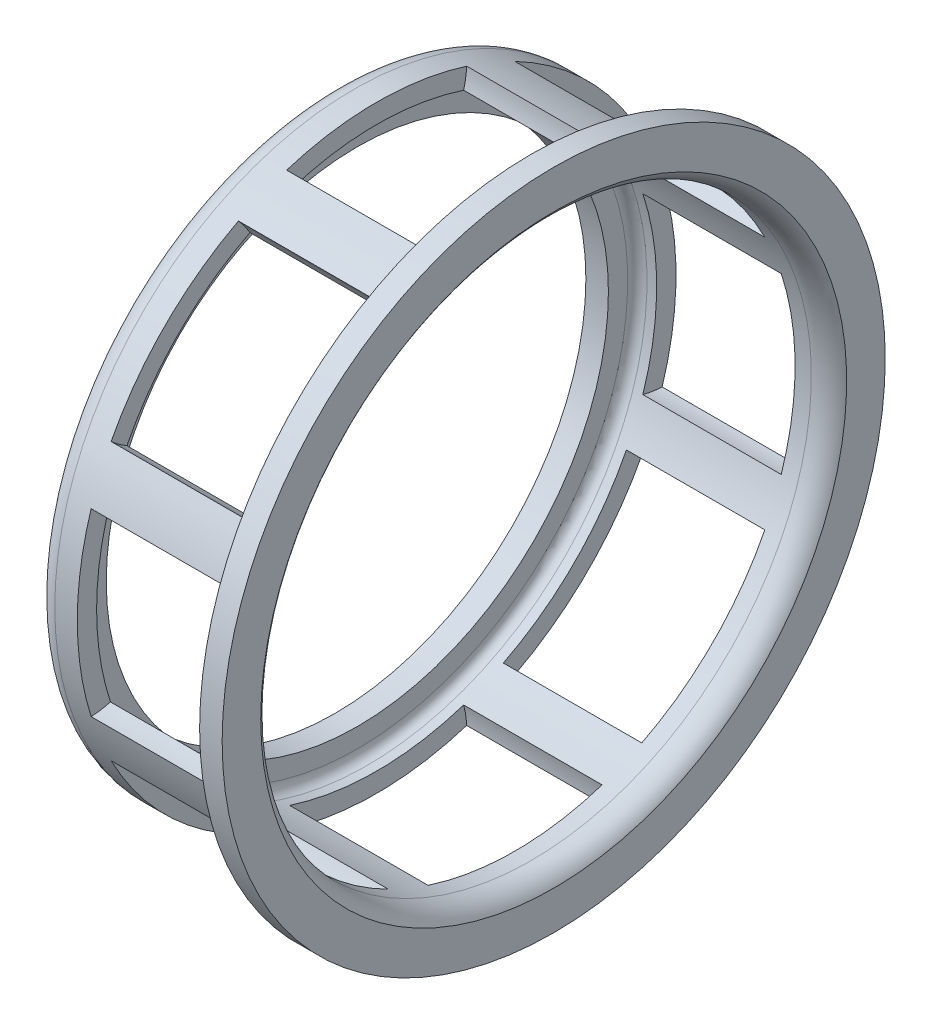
ISO-10303-21;
HEADER;
FILE_DESCRIPTION(('STEP AP214'),'2;1');
FILE_NAME('part.step','',(''),(''),'','','');
FILE_SCHEMA(('AUTOMOTIVE_DESIGN { 1 0 10303 214 1 1 1 1 }'));
ENDSEC;
DATA;
#1=APPLICATION_CONTEXT('core data for automotive mechanical design processes');
#2=APPLICATION_PROTOCOL_DEFINITION('international standard','automotive_design',2000,#1);
#3=PRODUCT_CONTEXT('',#1,'mechanical');
#4=PRODUCT('Part','Part','',(#3));
#5=PRODUCT_RELATED_PRODUCT_CATEGORY('part','',(#4));
#6=PRODUCT_DEFINITION_FORMATION('','',#4);
#7=PRODUCT_DEFINITION_CONTEXT('part definition',#1,'design');
#8=PRODUCT_DEFINITION('design','',#6,#7);
#9=PRODUCT_DEFINITION_SHAPE('','',#8);
#10=(LENGTH_UNIT() NAMED_UNIT(*) SI_UNIT(.MILLI.,.METRE.));
#11=(NAMED_UNIT(*) PLANE_ANGLE_UNIT() SI_UNIT($,.RADIAN.));
#12=(NAMED_UNIT(*) SI_UNIT($,.STERADIAN.) SOLID_ANGLE_UNIT());
#13=UNCERTAINTY_MEASURE_WITH_UNIT(LENGTH_MEASURE(1.E-05),#10,'distance_accuracy_value','');
#14=(GEOMETRIC_REPRESENTATION_CONTEXT(3) GLOBAL_UNCERTAINTY_ASSIGNED_CONTEXT((#13)) GLOBAL_UNIT_ASSIGNED_CONTEXT((#10,
#11,#12)) REPRESENTATION_CONTEXT('',''));
#15=CARTESIAN_POINT('',(0.,0.,0.));
#16=DIRECTION('',(0.,0.,1.));
#17=DIRECTION('',(1.,0.,0.));
#18=AXIS2_PLACEMENT_3D('',#15,#16,#17);
#19=CARTESIAN_POINT('',(-5.6,0.,0.));
#20=DIRECTION('',(-1.,0.,0.));
#21=DIRECTION('',(0.,0.,1.));
#22=AXIS2_PLACEMENT_3D('',#19,#20,#21);
#23=CYLINDRICAL_SURFACE('',#22,7.8);
#24=CARTESIAN_POINT('',(-2.7,0.,0.));
#25=DIRECTION('',(-1.,0.,0.));
#26=DIRECTION('',(0.,0.,1.));
#27=AXIS2_PLACEMENT_3D('',#24,#25,#26);
#28=CIRCLE('',#27,7.8);
#29=CARTESIAN_POINT('',(-2.7,0.,7.8));
#30=VERTEX_POINT('',#29);
#31=EDGE_CURVE('E381',#30,#30,#28,.T.);
#32=ORIENTED_EDGE('',*,*,#31,.F.);
#33=EDGE_LOOP('',(#32));
#34=FACE_BOUND('',#33,.T.);
#35=CARTESIAN_POINT('',(-3.4,0.,0.));
#36=DIRECTION('',(-1.,0.,0.));
#37=DIRECTION('',(0.,0.,1.));
#38=AXIS2_PLACEMENT_3D('',#35,#36,#37);
#39=CIRCLE('',#38,7.8);
#40=CARTESIAN_POINT('',(-3.4,0.,7.8));
#41=VERTEX_POINT('',#40);
#42=EDGE_CURVE('E414',#41,#41,#39,.T.);
#43=ORIENTED_EDGE('',*,*,#42,.T.);
#44=EDGE_LOOP('',(#43));
#45=FACE_BOUND('',#44,.T.);
#46=ADVANCED_FACE('F31',(#34,#45),#23,.F.);
#47=CARTESIAN_POINT('',(-3.4,7.8,0.));
#48=DIRECTION('',(-1.,0.,0.));
#49=DIRECTION('',(0.,0.,1.));
#50=AXIS2_PLACEMENT_3D('',#47,#48,#49);
#51=PLANE('',#50);
#52=CARTESIAN_POINT('',(-3.4,0.,0.));
#53=DIRECTION('',(-1.,0.,0.));
#54=DIRECTION('',(0.,0.,1.));
#55=AXIS2_PLACEMENT_3D('',#52,#53,#54);
#56=CIRCLE('',#55,8.7);
#57=CARTESIAN_POINT('',(-3.4,0.,8.7));
#58=VERTEX_POINT('',#57);
#59=EDGE_CURVE('E411',#58,#58,#56,.T.);
#60=ORIENTED_EDGE('',*,*,#59,.T.);
#61=EDGE_LOOP('',(#60));
#62=FACE_BOUND('',#61,.T.);
#63=ORIENTED_EDGE('',*,*,#42,.F.);
#64=EDGE_LOOP('',(#63));
#65=FACE_BOUND('',#64,.T.);
#66=ADVANCED_FACE('F544',(#62,#65),#51,.T.);
#67=CARTESIAN_POINT('',(-2.80000000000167,0.,0.));
#68=DIRECTION('',(-1.,0.,0.));
#69=DIRECTION('',(0.,0.,1.));
#70=AXIS2_PLACEMENT_3D('',#67,#68,#69);
#71=TOROIDAL_SURFACE('',#70,8.7,0.599999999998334);
#72=CARTESIAN_POINT('',(-2.80000000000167,0.,0.));
#73=DIRECTION('',(-1.,0.,0.));
#74=DIRECTION('',(0.,0.,1.));
#75=AXIS2_PLACEMENT_3D('',#72,#73,#74);
#76=CIRCLE('',#75,9.29999999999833);
#77=CARTESIAN_POINT('',(-2.80000000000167,0.,9.29999999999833));
#78=VERTEX_POINT('',#77);
#79=EDGE_CURVE('E408',#78,#78,#76,.T.);
#80=ORIENTED_EDGE('',*,*,#79,.T.);
#81=EDGE_LOOP('',(#80));
#82=FACE_BOUND('',#81,.T.);
#83=ORIENTED_EDGE('',*,*,#59,.F.);
#84=EDGE_LOOP('',(#83));
#85=FACE_BOUND('',#84,.T.);
#86=ADVANCED_FACE('F548',(#82,#85),#71,.T.);
#87=CARTESIAN_POINT('',(-5.6,0.,0.));
#88=DIRECTION('',(-1.,0.,0.));
#89=DIRECTION('',(0.,0.,1.));
#90=AXIS2_PLACEMENT_3D('',#87,#88,#89);
#91=CYLINDRICAL_SURFACE('',#90,9.29999999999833);
#92=DIRECTION('',(-1.,0.,0.));
#93=VECTOR('',#92,1.);
#94=CARTESIAN_POINT('',(0.0499999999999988,-8.24938990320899,-4.29389872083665));
#95=LINE('',#94,#93);
#96=CARTESIAN_POINT('',(2.2,-8.24938990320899,-4.29389872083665));
#97=VERTEX_POINT('',#96);
#98=CARTESIAN_POINT('',(-2.1,-8.24938990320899,-4.29389872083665));
#99=VERTEX_POINT('',#98);
#100=EDGE_CURVE('E241',#97,#99,#95,.T.);
#101=ORIENTED_EDGE('',*,*,#100,.F.);
#102=CARTESIAN_POINT('',(2.2,0.,0.));
#103=DIRECTION('',(-1.,0.,0.));
#104=DIRECTION('',(0.,0.,1.));
#105=AXIS2_PLACEMENT_3D('',#102,#103,#104);
#106=CIRCLE('',#105,9.29999999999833);
#107=CARTESIAN_POINT('',(2.2,-4.29389872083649,-8.24938990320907));
#108=VERTEX_POINT('',#107);
#109=EDGE_CURVE('E246',#97,#108,#106,.F.);
#110=ORIENTED_EDGE('',*,*,#109,.T.);
#111=DIRECTION('',(-1.,0.,0.));
#112=VECTOR('',#111,1.);
#113=CARTESIAN_POINT('',(0.0499999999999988,-4.29389872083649,-8.24938990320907));
#114=LINE('',#113,#112);
#115=CARTESIAN_POINT('',(-2.1,-4.29389872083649,-8.24938990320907));
#116=VERTEX_POINT('',#115);
#117=EDGE_CURVE('E236',#116,#108,#114,.F.);
#118=ORIENTED_EDGE('',*,*,#117,.F.);
#119=CARTESIAN_POINT('',(-2.1,0.,0.));
#120=DIRECTION('',(1.,0.,0.));
#121=DIRECTION('',(0.,0.,-1.));
#122=AXIS2_PLACEMENT_3D('',#119,#120,#121);
#123=CIRCLE('',#122,9.29999999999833);
#124=EDGE_CURVE('E257',#116,#99,#123,.F.);
#125=ORIENTED_EDGE('',*,*,#124,.T.);
#126=EDGE_LOOP('',(#101,#110,#118,#125));
#127=FACE_BOUND('',#126,.T.);
#128=DIRECTION('',(-1.,0.,0.));
#129=VECTOR('',#128,1.);
#130=CARTESIAN_POINT('',(0.0499999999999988,-8.86944444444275,2.79695463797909));
#131=LINE('',#130,#129);
#132=CARTESIAN_POINT('',(2.2,-8.86944444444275,2.79695463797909));
#133=VERTEX_POINT('',#132);
#134=CARTESIAN_POINT('',(-2.1,-8.86944444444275,2.79695463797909));
#135=VERTEX_POINT('',#134);
#136=EDGE_CURVE('E271',#133,#135,#131,.T.);
#137=ORIENTED_EDGE('',*,*,#136,.F.);
#138=CARTESIAN_POINT('',(2.2,0.,0.));
#139=DIRECTION('',(-1.,0.,0.));
#140=DIRECTION('',(0.,0.,1.));
#141=AXIS2_PLACEMENT_3D('',#138,#139,#140);
#142=CIRCLE('',#141,9.29999999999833);
#143=CARTESIAN_POINT('',(2.2,-8.8694444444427,-2.79695463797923));
#144=VERTEX_POINT('',#143);
#145=EDGE_CURVE('E276',#133,#144,#142,.F.);
#146=ORIENTED_EDGE('',*,*,#145,.T.);
#147=DIRECTION('',(-1.,0.,0.));
#148=VECTOR('',#147,1.);
#149=CARTESIAN_POINT('',(0.0499999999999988,-8.8694444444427,-2.79695463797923));
#150=LINE('',#149,#148);
#151=CARTESIAN_POINT('',(-2.1,-8.8694444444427,-2.79695463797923));
#152=VERTEX_POINT('',#151);
#153=EDGE_CURVE('E269',#152,#144,#150,.F.);
#154=ORIENTED_EDGE('',*,*,#153,.F.);
#155=CARTESIAN_POINT('',(-2.1,0.,0.));
#156=DIRECTION('',(1.,0.,0.));
#157=DIRECTION('',(0.,0.,-1.));
#158=AXIS2_PLACEMENT_3D('',#155,#156,#157);
#159=CIRCLE('',#158,9.29999999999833);
#160=EDGE_CURVE('E273',#152,#135,#159,.F.);
#161=ORIENTED_EDGE('',*,*,#160,.T.);
#162=EDGE_LOOP('',(#137,#146,#154,#161));
#163=FACE_BOUND('',#162,.T.);
#164=DIRECTION('',(-1.,0.,0.));
#165=VECTOR('',#164,1.);
#166=CARTESIAN_POINT('',(0.0499999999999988,-4.29389872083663,8.249389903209));
#167=LINE('',#166,#165);
#168=CARTESIAN_POINT('',(2.2,-4.29389872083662,8.249389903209));
#169=VERTEX_POINT('',#168);
#170=CARTESIAN_POINT('',(-2.1,-4.29389872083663,8.249389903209));
#171=VERTEX_POINT('',#170);
#172=EDGE_CURVE('E288',#169,#171,#167,.T.);
#173=ORIENTED_EDGE('',*,*,#172,.F.);
#174=CARTESIAN_POINT('',(2.2,0.,0.));
#175=DIRECTION('',(-1.,0.,0.));
#176=DIRECTION('',(0.,0.,1.));
#177=AXIS2_PLACEMENT_3D('',#174,#175,#176);
#178=CIRCLE('',#177,9.29999999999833);
#179=CARTESIAN_POINT('',(2.2,-8.24938990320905,4.29389872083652));
#180=VERTEX_POINT('',#179);
#181=EDGE_CURVE('E293',#169,#180,#178,.F.);
#182=ORIENTED_EDGE('',*,*,#181,.T.);
#183=DIRECTION('',(-1.,0.,0.));
#184=VECTOR('',#183,1.);
#185=CARTESIAN_POINT('',(0.0499999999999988,-8.24938990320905,4.29389872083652));
#186=LINE('',#185,#184);
#187=CARTESIAN_POINT('',(-2.1,-8.24938990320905,4.29389872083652));
#188=VERTEX_POINT('',#187);
#189=EDGE_CURVE('E286',#188,#180,#186,.F.);
#190=ORIENTED_EDGE('',*,*,#189,.F.);
#191=CARTESIAN_POINT('',(-2.1,0.,0.));
#192=DIRECTION('',(1.,0.,0.));
#193=DIRECTION('',(0.,0.,-1.));
#194=AXIS2_PLACEMENT_3D('',#191,#192,#193);
#195=CIRCLE('',#194,9.29999999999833);
#196=EDGE_CURVE('E290',#188,#171,#195,.F.);
#197=ORIENTED_EDGE('',*,*,#196,.T.);
#198=EDGE_LOOP('',(#173,#182,#190,#197));
#199=FACE_BOUND('',#198,.T.);
#200=DIRECTION('',(-1.,0.,0.));
#201=VECTOR('',#200,1.);
#202=CARTESIAN_POINT('',(0.0499999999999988,2.79695463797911,8.86944444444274));
#203=LINE('',#202,#201);
#204=CARTESIAN_POINT('',(2.2,2.79695463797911,8.86944444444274));
#205=VERTEX_POINT('',#204);
#206=CARTESIAN_POINT('',(-2.1,2.79695463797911,8.86944444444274));
#207=VERTEX_POINT('',#206);
#208=EDGE_CURVE('E305',#205,#207,#203,.T.);
#209=ORIENTED_EDGE('',*,*,#208,.F.);
#210=CARTESIAN_POINT('',(2.2,0.,0.));
#211=DIRECTION('',(-1.,0.,0.));
#212=DIRECTION('',(0.,0.,1.));
#213=AXIS2_PLACEMENT_3D('',#210,#211,#212);
#214=CIRCLE('',#213,9.29999999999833);
#215=CARTESIAN_POINT('',(2.2,-2.79695463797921,8.86944444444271));
#216=VERTEX_POINT('',#215);
#217=EDGE_CURVE('E310',#205,#216,#214,.F.);
#218=ORIENTED_EDGE('',*,*,#217,.T.);
#219=DIRECTION('',(-1.,0.,0.));
#220=VECTOR('',#219,1.);
#221=CARTESIAN_POINT('',(0.0499999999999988,-2.7969546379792,8.86944444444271));
#222=LINE('',#221,#220);
#223=CARTESIAN_POINT('',(-2.1,-2.7969546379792,8.86944444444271));
#224=VERTEX_POINT('',#223);
#225=EDGE_CURVE('E303',#224,#216,#222,.F.);
#226=ORIENTED_EDGE('',*,*,#225,.F.);
#227=CARTESIAN_POINT('',(-2.1,0.,0.));
#228=DIRECTION('',(1.,0.,0.));
#229=DIRECTION('',(0.,0.,-1.));
#230=AXIS2_PLACEMENT_3D('',#227,#228,#229);
#231=CIRCLE('',#230,9.29999999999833);
#232=EDGE_CURVE('E307',#224,#207,#231,.F.);
#233=ORIENTED_EDGE('',*,*,#232,.T.);
#234=EDGE_LOOP('',(#209,#218,#226,#233));
#235=FACE_BOUND('',#234,.T.);
#236=DIRECTION('',(-1.,0.,0.));
#237=VECTOR('',#236,1.);
#238=CARTESIAN_POINT('',(0.0499999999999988,8.24938990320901,4.2938987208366));
#239=LINE('',#238,#237);
#240=CARTESIAN_POINT('',(2.2,8.24938990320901,4.2938987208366));
#241=VERTEX_POINT('',#240);
#242=CARTESIAN_POINT('',(-2.1,8.24938990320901,4.29389872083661));
#243=VERTEX_POINT('',#242);
#244=EDGE_CURVE('E322',#241,#243,#239,.T.);
#245=ORIENTED_EDGE('',*,*,#244,.F.);
#246=CARTESIAN_POINT('',(2.2,0.,0.));
#247=DIRECTION('',(-1.,0.,0.));
#248=DIRECTION('',(0.,0.,1.));
#249=AXIS2_PLACEMENT_3D('',#246,#247,#248);
#250=CIRCLE('',#249,9.29999999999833);
#251=CARTESIAN_POINT('',(2.2,4.29389872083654,8.24938990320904));
#252=VERTEX_POINT('',#251);
#253=EDGE_CURVE('E327',#241,#252,#250,.F.);
#254=ORIENTED_EDGE('',*,*,#253,.T.);
#255=DIRECTION('',(-1.,0.,0.));
#256=VECTOR('',#255,1.);
#257=CARTESIAN_POINT('',(0.0499999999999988,4.29389872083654,8.24938990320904));
#258=LINE('',#257,#256);
#259=CARTESIAN_POINT('',(-2.1,4.29389872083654,8.24938990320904));
#260=VERTEX_POINT('',#259);
#261=EDGE_CURVE('E320',#260,#252,#258,.F.);
#262=ORIENTED_EDGE('',*,*,#261,.F.);
#263=CARTESIAN_POINT('',(-2.1,0.,0.));
#264=DIRECTION('',(1.,0.,0.));
#265=DIRECTION('',(0.,0.,-1.));
#266=AXIS2_PLACEMENT_3D('',#263,#264,#265);
#267=CIRCLE('',#266,9.29999999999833);
#268=EDGE_CURVE('E324',#260,#243,#267,.F.);
#269=ORIENTED_EDGE('',*,*,#268,.T.);
#270=EDGE_LOOP('',(#245,#254,#262,#269));
#271=FACE_BOUND('',#270,.T.);
#272=DIRECTION('',(-1.,0.,0.));
#273=VECTOR('',#272,1.);
#274=CARTESIAN_POINT('',(0.0499999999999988,8.86944444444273,-2.79695463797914));
#275=LINE('',#274,#273);
#276=CARTESIAN_POINT('',(2.2,8.86944444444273,-2.79695463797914));
#277=VERTEX_POINT('',#276);
#278=CARTESIAN_POINT('',(-2.1,8.86944444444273,-2.79695463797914));
#279=VERTEX_POINT('',#278);
#280=EDGE_CURVE('E339',#277,#279,#275,.T.);
#281=ORIENTED_EDGE('',*,*,#280,.F.);
#282=CARTESIAN_POINT('',(2.2,0.,0.));
#283=DIRECTION('',(-1.,0.,0.));
#284=DIRECTION('',(0.,0.,1.));
#285=AXIS2_PLACEMENT_3D('',#282,#283,#284);
#286=CIRCLE('',#285,9.29999999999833);
#287=CARTESIAN_POINT('',(2.2,8.86944444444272,2.79695463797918));
#288=VERTEX_POINT('',#287);
#289=EDGE_CURVE('E344',#277,#288,#286,.F.);
#290=ORIENTED_EDGE('',*,*,#289,.T.);
#291=DIRECTION('',(-1.,0.,0.));
#292=VECTOR('',#291,1.);
#293=CARTESIAN_POINT('',(0.0499999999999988,8.86944444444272,2.79695463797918));
#294=LINE('',#293,#292);
#295=CARTESIAN_POINT('',(-2.1,8.86944444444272,2.79695463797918));
#296=VERTEX_POINT('',#295);
#297=EDGE_CURVE('E337',#296,#288,#294,.F.);
#298=ORIENTED_EDGE('',*,*,#297,.F.);
#299=CARTESIAN_POINT('',(-2.1,0.,0.));
#300=DIRECTION('',(1.,0.,0.));
#301=DIRECTION('',(0.,0.,-1.));
#302=AXIS2_PLACEMENT_3D('',#299,#300,#301);
#303=CIRCLE('',#302,9.29999999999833);
#304=EDGE_CURVE('E341',#296,#279,#303,.F.);
#305=ORIENTED_EDGE('',*,*,#304,.T.);
#306=EDGE_LOOP('',(#281,#290,#298,#305));
#307=FACE_BOUND('',#306,.T.);
#308=DIRECTION('',(-1.,0.,0.));
#309=VECTOR('',#308,1.);
#310=CARTESIAN_POINT('',(0.0499999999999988,4.29389872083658,-8.24938990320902));
#311=LINE('',#310,#309);
#312=CARTESIAN_POINT('',(2.2,4.29389872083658,-8.24938990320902));
#313=VERTEX_POINT('',#312);
#314=CARTESIAN_POINT('',(-2.1,4.29389872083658,-8.24938990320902));
#315=VERTEX_POINT('',#314);
#316=EDGE_CURVE('E356',#313,#315,#311,.T.);
#317=ORIENTED_EDGE('',*,*,#316,.F.);
#318=CARTESIAN_POINT('',(2.2,0.,0.));
#319=DIRECTION('',(-1.,0.,0.));
#320=DIRECTION('',(0.,0.,1.));
#321=AXIS2_PLACEMENT_3D('',#318,#319,#320);
#322=CIRCLE('',#321,9.29999999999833);
#323=CARTESIAN_POINT('',(2.2,8.24938990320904,-4.29389872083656));
#324=VERTEX_POINT('',#323);
#325=EDGE_CURVE('E361',#313,#324,#322,.F.);
#326=ORIENTED_EDGE('',*,*,#325,.T.);
#327=DIRECTION('',(-1.,0.,0.));
#328=VECTOR('',#327,1.);
#329=CARTESIAN_POINT('',(0.0499999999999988,8.24938990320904,-4.29389872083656));
#330=LINE('',#329,#328);
#331=CARTESIAN_POINT('',(-2.1,8.24938990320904,-4.29389872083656));
#332=VERTEX_POINT('',#331);
#333=EDGE_CURVE('E354',#332,#324,#330,.F.);
#334=ORIENTED_EDGE('',*,*,#333,.F.);
#335=CARTESIAN_POINT('',(-2.1,0.,0.));
#336=DIRECTION('',(1.,0.,0.));
#337=DIRECTION('',(0.,0.,-1.));
#338=AXIS2_PLACEMENT_3D('',#335,#336,#337);
#339=CIRCLE('',#338,9.29999999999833);
#340=EDGE_CURVE('E358',#332,#315,#339,.F.);
#341=ORIENTED_EDGE('',*,*,#340,.T.);
#342=EDGE_LOOP('',(#317,#326,#334,#341));
#343=FACE_BOUND('',#342,.T.);
#344=DIRECTION('',(-1.,0.,0.));
#345=VECTOR('',#344,1.);
#346=CARTESIAN_POINT('',(0.0499999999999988,-2.79695463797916,-8.86944444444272));
#347=LINE('',#346,#345);
#348=CARTESIAN_POINT('',(2.2,-2.79695463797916,-8.86944444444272));
#349=VERTEX_POINT('',#348);
#350=CARTESIAN_POINT('',(-2.1,-2.79695463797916,-8.86944444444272));
#351=VERTEX_POINT('',#350);
#352=EDGE_CURVE('E373',#349,#351,#347,.T.);
#353=ORIENTED_EDGE('',*,*,#352,.F.);
#354=CARTESIAN_POINT('',(2.2,0.,0.));
#355=DIRECTION('',(-1.,0.,0.));
#356=DIRECTION('',(0.,0.,1.));
#357=AXIS2_PLACEMENT_3D('',#354,#355,#356);
#358=CIRCLE('',#357,9.29999999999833);
#359=CARTESIAN_POINT('',(2.2,2.79695463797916,-8.86944444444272));
#360=VERTEX_POINT('',#359);
#361=EDGE_CURVE('E378',#349,#360,#358,.F.);
#362=ORIENTED_EDGE('',*,*,#361,.T.);
#363=DIRECTION('',(-1.,0.,0.));
#364=VECTOR('',#363,1.);
#365=CARTESIAN_POINT('',(0.0499999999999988,2.79695463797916,-8.86944444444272));
#366=LINE('',#365,#364);
#367=CARTESIAN_POINT('',(-2.1,2.79695463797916,-8.86944444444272));
#368=VERTEX_POINT('',#367);
#369=EDGE_CURVE('E371',#368,#360,#366,.F.);
#370=ORIENTED_EDGE('',*,*,#369,.F.);
#371=CARTESIAN_POINT('',(-2.1,0.,0.));
#372=DIRECTION('',(1.,0.,0.));
#373=DIRECTION('',(0.,0.,-1.));
#374=AXIS2_PLACEMENT_3D('',#371,#372,#373);
#375=CIRCLE('',#374,9.29999999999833);
#376=EDGE_CURVE('E375',#368,#351,#375,.F.);
#377=ORIENTED_EDGE('',*,*,#376,.T.);
#378=EDGE_LOOP('',(#353,#362,#370,#377));
#379=FACE_BOUND('',#378,.T.);
#380=CARTESIAN_POINT('',(2.52679491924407,0.,0.));
#381=DIRECTION('',(-1.,0.,0.));
#382=DIRECTION('',(0.,0.,1.));
#383=AXIS2_PLACEMENT_3D('',#380,#381,#382);
#384=CIRCLE('',#383,9.29999999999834);
#385=CARTESIAN_POINT('',(2.52679491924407,0.,9.29999999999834));
#386=VERTEX_POINT('',#385);
#387=EDGE_CURVE('E405',#386,#386,#384,.T.);
#388=ORIENTED_EDGE('',*,*,#387,.T.);
#389=EDGE_LOOP('',(#388));
#390=FACE_BOUND('',#389,.T.);
#391=ORIENTED_EDGE('',*,*,#79,.F.);
#392=EDGE_LOOP('',(#391));
#393=FACE_BOUND('',#392,.T.);
#394=ADVANCED_FACE('F254',(#127,#163,#199,#235,#271,#307,#343,#379,#390,#393),#91,.T.);
#395=CARTESIAN_POINT('',(2.52679491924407,0.,0.));
#396=DIRECTION('',(-1.,0.,0.));
#397=DIRECTION('',(0.,0.,1.));
#398=AXIS2_PLACEMENT_3D('',#395,#396,#397);
#399=TOROIDAL_SURFACE('',#398,9.49999999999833,0.2);
#400=ORIENTED_EDGE('',*,*,#387,.F.);
#401=EDGE_LOOP('',(#400));
#402=FACE_BOUND('',#401,.T.);
#403=CARTESIAN_POINT('',(2.7,0.,0.));
#404=DIRECTION('',(-1.,0.,0.));
#405=DIRECTION('',(0.,0.,1.));
#406=AXIS2_PLACEMENT_3D('',#403,#404,#405);
#407=CIRCLE('',#406,9.6);
#408=CARTESIAN_POINT('',(2.7,0.,9.6));
#409=VERTEX_POINT('',#408);
#410=EDGE_CURVE('E402',#409,#409,#407,.T.);
#411=ORIENTED_EDGE('',*,*,#410,.T.);
#412=EDGE_LOOP('',(#411));
#413=FACE_BOUND('',#412,.T.);
#414=ADVANCED_FACE('F558',(#402,#413),#399,.F.);
#415=CARTESIAN_POINT('',(2.7,10.3,0.));
#416=DIRECTION('',(1.,0.,0.));
#417=DIRECTION('',(0.,0.,-1.));
#418=AXIS2_PLACEMENT_3D('',#415,#416,#417);
#419=PLANE('',#418);
#420=ORIENTED_EDGE('',*,*,#410,.F.);
#421=EDGE_LOOP('',(#420));
#422=FACE_BOUND('',#421,.T.);
#423=CARTESIAN_POINT('',(2.7,0.,0.));
#424=DIRECTION('',(-1.,0.,0.));
#425=DIRECTION('',(0.,0.,1.));
#426=AXIS2_PLACEMENT_3D('',#423,#424,#425);
#427=CIRCLE('',#426,10.3);
#428=CARTESIAN_POINT('',(2.7,0.,10.3));
#429=VERTEX_POINT('',#428);
#430=EDGE_CURVE('E399',#429,#429,#427,.T.);
#431=ORIENTED_EDGE('',*,*,#430,.T.);
#432=EDGE_LOOP('',(#431));
#433=FACE_BOUND('',#432,.T.);
#434=ADVANCED_FACE('F561',(#422,#433),#419,.F.);
#435=CARTESIAN_POINT('',(-5.6,0.,0.));
#436=DIRECTION('',(-1.,0.,0.));
#437=DIRECTION('',(0.,0.,1.));
#438=AXIS2_PLACEMENT_3D('',#435,#436,#437);
#439=CYLINDRICAL_SURFACE('',#438,10.3);
#440=ORIENTED_EDGE('',*,*,#430,.F.);
#441=EDGE_LOOP('',(#440));
#442=FACE_BOUND('',#441,.T.);
#443=CARTESIAN_POINT('',(3.4,0.,0.));
#444=DIRECTION('',(-1.,0.,0.));
#445=DIRECTION('',(0.,0.,1.));
#446=AXIS2_PLACEMENT_3D('',#443,#444,#445);
#447=CIRCLE('',#446,10.3);
#448=CARTESIAN_POINT('',(3.4,0.,10.3));
#449=VERTEX_POINT('',#448);
#450=EDGE_CURVE('E396',#449,#449,#447,.T.);
#451=ORIENTED_EDGE('',*,*,#450,.T.);
#452=EDGE_LOOP('',(#451));
#453=FACE_BOUND('',#452,.T.);
#454=ADVANCED_FACE('F565',(#442,#453),#439,.T.);
#455=CARTESIAN_POINT('',(3.4,10.3,0.));
#456=DIRECTION('',(1.,0.,0.));
#457=DIRECTION('',(0.,0.,-1.));
#458=AXIS2_PLACEMENT_3D('',#455,#456,#457);
#459=PLANE('',#458);
#460=CARTESIAN_POINT('',(3.4,0.,0.));
#461=DIRECTION('',(-1.,0.,0.));
#462=DIRECTION('',(0.,0.,1.));
#463=AXIS2_PLACEMENT_3D('',#460,#461,#462);
#464=CIRCLE('',#463,9.10157173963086);
#465=CARTESIAN_POINT('',(3.4,0.,9.10157173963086));
#466=VERTEX_POINT('',#465);
#467=EDGE_CURVE('E393',#466,#466,#464,.T.);
#468=ORIENTED_EDGE('',*,*,#467,.T.);
#469=EDGE_LOOP('',(#468));
#470=FACE_BOUND('',#469,.T.);
#471=ORIENTED_EDGE('',*,*,#450,.F.);
#472=EDGE_LOOP('',(#471));
#473=FACE_BOUND('',#472,.T.);
#474=ADVANCED_FACE('F569',(#470,#473),#459,.T.);
#475=CARTESIAN_POINT('',(2.70627460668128,0.,0.));
#476=DIRECTION('',(-1.,0.,0.));
#477=DIRECTION('',(0.,0.,1.));
#478=AXIS2_PLACEMENT_3D('',#475,#476,#477);
#479=TOROIDAL_SURFACE('',#478,9.50000000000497,0.79999999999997);
#480=CARTESIAN_POINT('',(2.70627460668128,0.,0.));
#481=DIRECTION('',(-1.,0.,0.));
#482=DIRECTION('',(0.,0.,1.));
#483=AXIS2_PLACEMENT_3D('',#480,#481,#482);
#484=CIRCLE('',#483,8.700000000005);
#485=CARTESIAN_POINT('',(2.70627460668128,0.,8.700000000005));
#486=VERTEX_POINT('',#485);
#487=EDGE_CURVE('E390',#486,#486,#484,.T.);
#488=ORIENTED_EDGE('',*,*,#487,.T.);
#489=EDGE_LOOP('',(#488));
#490=FACE_BOUND('',#489,.T.);
#491=ORIENTED_EDGE('',*,*,#467,.F.);
#492=EDGE_LOOP('',(#491));
#493=FACE_BOUND('',#492,.T.);
#494=ADVANCED_FACE('F510',(#490,#493),#479,.T.);
#495=CARTESIAN_POINT('',(-5.6,0.,0.));
#496=DIRECTION('',(-1.,0.,0.));
#497=DIRECTION('',(0.,0.,1.));
#498=AXIS2_PLACEMENT_3D('',#495,#496,#497);
#499=CYLINDRICAL_SURFACE('',#498,8.700000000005);
#500=CARTESIAN_POINT('',(2.2,0.,0.));
#501=DIRECTION('',(-1.,0.,0.));
#502=DIRECTION('',(0.,0.,1.));
#503=AXIS2_PLACEMENT_3D('',#500,#501,#502);
#504=CIRCLE('',#503,8.700000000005);
#505=CARTESIAN_POINT('',(2.2,-7.75870028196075,-3.9360602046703));
#506=VERTEX_POINT('',#505);
#507=CARTESIAN_POINT('',(2.2,-3.93606020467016,-7.75870028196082));
#508=VERTEX_POINT('',#507);
#509=EDGE_CURVE('E38',#506,#508,#504,.F.);
#510=ORIENTED_EDGE('',*,*,#509,.F.);
#511=DIRECTION('',(-1.,0.,0.));
#512=VECTOR('',#511,1.);
#513=CARTESIAN_POINT('',(0.0499999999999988,-7.75870028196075,-3.9360602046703));
#514=LINE('',#513,#512);
#515=CARTESIAN_POINT('',(-2.1,-7.75870028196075,-3.9360602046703));
#516=VERTEX_POINT('',#515);
#517=EDGE_CURVE('E11',#506,#516,#514,.T.);
#518=ORIENTED_EDGE('',*,*,#517,.T.);
#519=CARTESIAN_POINT('',(-2.1,0.,0.));
#520=DIRECTION('',(1.,0.,0.));
#521=DIRECTION('',(0.,0.,-1.));
#522=AXIS2_PLACEMENT_3D('',#519,#520,#521);
#523=CIRCLE('',#522,8.700000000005);
#524=CARTESIAN_POINT('',(-2.1,-3.93606020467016,-7.75870028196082));
#525=VERTEX_POINT('',#524);
#526=EDGE_CURVE('E496',#525,#516,#523,.F.);
#527=ORIENTED_EDGE('',*,*,#526,.F.);
#528=DIRECTION('',(-1.,0.,0.));
#529=VECTOR('',#528,1.);
#530=CARTESIAN_POINT('',(0.0499999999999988,-3.93606020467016,-7.75870028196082));
#531=LINE('',#530,#529);
#532=EDGE_CURVE('E494',#525,#508,#531,.F.);
#533=ORIENTED_EDGE('',*,*,#532,.T.);
#534=EDGE_LOOP('',(#510,#518,#527,#533));
#535=FACE_BOUND('',#534,.T.);
#536=CARTESIAN_POINT('',(2.2,0.,0.));
#537=DIRECTION('',(-1.,0.,0.));
#538=DIRECTION('',(0.,0.,1.));
#539=AXIS2_PLACEMENT_3D('',#536,#537,#538);
#540=CIRCLE('',#539,8.700000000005);
#541=CARTESIAN_POINT('',(2.2,-8.2694444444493,2.70301472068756));
#542=VERTEX_POINT('',#541);
#543=CARTESIAN_POINT('',(2.2,-8.26944444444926,-2.70301472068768));
#544=VERTEX_POINT('',#543);
#545=EDGE_CURVE('E488',#542,#544,#540,.F.);
#546=ORIENTED_EDGE('',*,*,#545,.F.);
#547=DIRECTION('',(-1.,0.,0.));
#548=VECTOR('',#547,1.);
#549=CARTESIAN_POINT('',(0.0499999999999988,-8.2694444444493,2.70301472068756));
#550=LINE('',#549,#548);
#551=CARTESIAN_POINT('',(-2.1,-8.2694444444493,2.70301472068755));
#552=VERTEX_POINT('',#551);
#553=EDGE_CURVE('E491',#542,#552,#550,.T.);
#554=ORIENTED_EDGE('',*,*,#553,.T.);
#555=CARTESIAN_POINT('',(-2.1,0.,0.));
#556=DIRECTION('',(1.,0.,0.));
#557=DIRECTION('',(0.,0.,-1.));
#558=AXIS2_PLACEMENT_3D('',#555,#556,#557);
#559=CIRCLE('',#558,8.700000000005);
#560=CARTESIAN_POINT('',(-2.1,-8.26944444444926,-2.70301472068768));
#561=VERTEX_POINT('',#560);
#562=EDGE_CURVE('E486',#561,#552,#559,.F.);
#563=ORIENTED_EDGE('',*,*,#562,.F.);
#564=DIRECTION('',(-1.,0.,0.));
#565=VECTOR('',#564,1.);
#566=CARTESIAN_POINT('',(0.0499999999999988,-8.26944444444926,-2.70301472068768));
#567=LINE('',#566,#565);
#568=EDGE_CURVE('E483',#561,#544,#567,.F.);
#569=ORIENTED_EDGE('',*,*,#568,.T.);
#570=EDGE_LOOP('',(#546,#554,#563,#569));
#571=FACE_BOUND('',#570,.T.);
#572=CARTESIAN_POINT('',(2.2,0.,0.));
#573=DIRECTION('',(-1.,0.,0.));
#574=DIRECTION('',(0.,0.,1.));
#575=AXIS2_PLACEMENT_3D('',#572,#573,#574);
#576=CIRCLE('',#575,8.700000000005);
#577=CARTESIAN_POINT('',(2.2,-3.93606020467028,7.75870028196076));
#578=VERTEX_POINT('',#577);
#579=CARTESIAN_POINT('',(2.2,-7.75870028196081,3.93606020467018));
#580=VERTEX_POINT('',#579);
#581=EDGE_CURVE('E477',#578,#580,#576,.F.);
#582=ORIENTED_EDGE('',*,*,#581,.F.);
#583=DIRECTION('',(-1.,0.,0.));
#584=VECTOR('',#583,1.);
#585=CARTESIAN_POINT('',(0.0499999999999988,-3.93606020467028,7.75870028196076));
#586=LINE('',#585,#584);
#587=CARTESIAN_POINT('',(-2.1,-3.93606020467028,7.75870028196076));
#588=VERTEX_POINT('',#587);
#589=EDGE_CURVE('E480',#578,#588,#586,.T.);
#590=ORIENTED_EDGE('',*,*,#589,.T.);
#591=CARTESIAN_POINT('',(-2.1,0.,0.));
#592=DIRECTION('',(1.,0.,0.));
#593=DIRECTION('',(0.,0.,-1.));
#594=AXIS2_PLACEMENT_3D('',#591,#592,#593);
#595=CIRCLE('',#594,8.700000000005);
#596=CARTESIAN_POINT('',(-2.1,-7.75870028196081,3.93606020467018));
#597=VERTEX_POINT('',#596);
#598=EDGE_CURVE('E475',#597,#588,#595,.F.);
#599=ORIENTED_EDGE('',*,*,#598,.F.);
#600=DIRECTION('',(-1.,0.,0.));
#601=VECTOR('',#600,1.);
#602=CARTESIAN_POINT('',(0.0499999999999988,-7.75870028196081,3.93606020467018));
#603=LINE('',#602,#601);
#604=EDGE_CURVE('E472',#597,#580,#603,.F.);
#605=ORIENTED_EDGE('',*,*,#604,.T.);
#606=EDGE_LOOP('',(#582,#590,#599,#605));
#607=FACE_BOUND('',#606,.T.);
#608=CARTESIAN_POINT('',(2.2,0.,0.));
#609=DIRECTION('',(-1.,0.,0.));
#610=DIRECTION('',(0.,0.,1.));
#611=AXIS2_PLACEMENT_3D('',#608,#609,#610);
#612=CIRCLE('',#611,8.700000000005);
#613=CARTESIAN_POINT('',(2.2,2.70301472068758,8.26944444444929));
#614=VERTEX_POINT('',#613);
#615=CARTESIAN_POINT('',(2.2,-2.70301472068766,8.26944444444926));
#616=VERTEX_POINT('',#615);
#617=EDGE_CURVE('E466',#614,#616,#612,.F.);
#618=ORIENTED_EDGE('',*,*,#617,.F.);
#619=DIRECTION('',(-1.,0.,0.));
#620=VECTOR('',#619,1.);
#621=CARTESIAN_POINT('',(0.0499999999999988,2.70301472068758,8.26944444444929));
#622=LINE('',#621,#620);
#623=CARTESIAN_POINT('',(-2.1,2.70301472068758,8.26944444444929));
#624=VERTEX_POINT('',#623);
#625=EDGE_CURVE('E469',#614,#624,#622,.T.);
#626=ORIENTED_EDGE('',*,*,#625,.T.);
#627=CARTESIAN_POINT('',(-2.1,0.,0.));
#628=DIRECTION('',(1.,0.,0.));
#629=DIRECTION('',(0.,0.,-1.));
#630=AXIS2_PLACEMENT_3D('',#627,#628,#629);
#631=CIRCLE('',#630,8.700000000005);
#632=CARTESIAN_POINT('',(-2.1,-2.70301472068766,8.26944444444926));
#633=VERTEX_POINT('',#632);
#634=EDGE_CURVE('E464',#633,#624,#631,.F.);
#635=ORIENTED_EDGE('',*,*,#634,.F.);
#636=DIRECTION('',(-1.,0.,0.));
#637=VECTOR('',#636,1.);
#638=CARTESIAN_POINT('',(0.0499999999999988,-2.70301472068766,8.26944444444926));
#639=LINE('',#638,#637);
#640=EDGE_CURVE('E461',#633,#616,#639,.F.);
#641=ORIENTED_EDGE('',*,*,#640,.T.);
#642=EDGE_LOOP('',(#618,#626,#635,#641));
#643=FACE_BOUND('',#642,.T.);
#644=CARTESIAN_POINT('',(2.2,0.,0.));
#645=DIRECTION('',(-1.,0.,0.));
#646=DIRECTION('',(0.,0.,1.));
#647=AXIS2_PLACEMENT_3D('',#644,#645,#646);
#648=CIRCLE('',#647,8.700000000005);
#649=CARTESIAN_POINT('',(2.2,7.75870028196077,3.93606020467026));
#650=VERTEX_POINT('',#649);
#651=CARTESIAN_POINT('',(2.2,3.9360602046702,7.7587002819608));
#652=VERTEX_POINT('',#651);
#653=EDGE_CURVE('E455',#650,#652,#648,.F.);
#654=ORIENTED_EDGE('',*,*,#653,.F.);
#655=DIRECTION('',(-1.,0.,0.));
#656=VECTOR('',#655,1.);
#657=CARTESIAN_POINT('',(0.0499999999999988,7.75870028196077,3.93606020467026));
#658=LINE('',#657,#656);
#659=CARTESIAN_POINT('',(-2.1,7.75870028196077,3.93606020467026));
#660=VERTEX_POINT('',#659);
#661=EDGE_CURVE('E458',#650,#660,#658,.T.);
#662=ORIENTED_EDGE('',*,*,#661,.T.);
#663=CARTESIAN_POINT('',(-2.1,0.,0.));
#664=DIRECTION('',(1.,0.,0.));
#665=DIRECTION('',(0.,0.,-1.));
#666=AXIS2_PLACEMENT_3D('',#663,#664,#665);
#667=CIRCLE('',#666,8.700000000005);
#668=CARTESIAN_POINT('',(-2.1,3.9360602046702,7.7587002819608));
#669=VERTEX_POINT('',#668);
#670=EDGE_CURVE('E453',#669,#660,#667,.F.);
#671=ORIENTED_EDGE('',*,*,#670,.F.);
#672=DIRECTION('',(-1.,0.,0.));
#673=VECTOR('',#672,1.);
#674=CARTESIAN_POINT('',(0.0499999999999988,3.9360602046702,7.7587002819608));
#675=LINE('',#674,#673);
#676=EDGE_CURVE('E450',#669,#652,#675,.F.);
#677=ORIENTED_EDGE('',*,*,#676,.T.);
#678=EDGE_LOOP('',(#654,#662,#671,#677));
#679=FACE_BOUND('',#678,.T.);
#680=CARTESIAN_POINT('',(2.2,0.,0.));
#681=DIRECTION('',(-1.,0.,0.));
#682=DIRECTION('',(0.,0.,1.));
#683=AXIS2_PLACEMENT_3D('',#680,#681,#682);
#684=CIRCLE('',#683,8.700000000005);
#685=CARTESIAN_POINT('',(2.2,8.26944444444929,-2.7030147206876));
#686=VERTEX_POINT('',#685);
#687=CARTESIAN_POINT('',(2.2,8.26944444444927,2.70301472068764));
#688=VERTEX_POINT('',#687);
#689=EDGE_CURVE('E444',#686,#688,#684,.F.);
#690=ORIENTED_EDGE('',*,*,#689,.F.);
#691=DIRECTION('',(-1.,0.,0.));
#692=VECTOR('',#691,1.);
#693=CARTESIAN_POINT('',(0.0499999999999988,8.26944444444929,-2.7030147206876));
#694=LINE('',#693,#692);
#695=CARTESIAN_POINT('',(-2.1,8.26944444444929,-2.7030147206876));
#696=VERTEX_POINT('',#695);
#697=EDGE_CURVE('E447',#686,#696,#694,.T.);
#698=ORIENTED_EDGE('',*,*,#697,.T.);
#699=CARTESIAN_POINT('',(-2.1,0.,0.));
#700=DIRECTION('',(1.,0.,0.));
#701=DIRECTION('',(0.,0.,-1.));
#702=AXIS2_PLACEMENT_3D('',#699,#700,#701);
#703=CIRCLE('',#702,8.700000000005);
#704=CARTESIAN_POINT('',(-2.1,8.26944444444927,2.70301472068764));
#705=VERTEX_POINT('',#704);
#706=EDGE_CURVE('E442',#705,#696,#703,.F.);
#707=ORIENTED_EDGE('',*,*,#706,.F.);
#708=DIRECTION('',(-1.,0.,0.));
#709=VECTOR('',#708,1.);
#710=CARTESIAN_POINT('',(0.0499999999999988,8.26944444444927,2.70301472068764));
#711=LINE('',#710,#709);
#712=EDGE_CURVE('E439',#705,#688,#711,.F.);
#713=ORIENTED_EDGE('',*,*,#712,.T.);
#714=EDGE_LOOP('',(#690,#698,#707,#713));
#715=FACE_BOUND('',#714,.T.);
#716=CARTESIAN_POINT('',(2.2,0.,0.));
#717=DIRECTION('',(-1.,0.,0.));
#718=DIRECTION('',(0.,0.,1.));
#719=AXIS2_PLACEMENT_3D('',#716,#717,#718);
#720=CIRCLE('',#719,8.700000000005);
#721=CARTESIAN_POINT('',(2.2,3.93606020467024,-7.75870028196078));
#722=VERTEX_POINT('',#721);
#723=CARTESIAN_POINT('',(2.2,7.75870028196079,-3.93606020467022));
#724=VERTEX_POINT('',#723);
#725=EDGE_CURVE('E433',#722,#724,#720,.F.);
#726=ORIENTED_EDGE('',*,*,#725,.F.);
#727=DIRECTION('',(-1.,0.,0.));
#728=VECTOR('',#727,1.);
#729=CARTESIAN_POINT('',(0.0499999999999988,3.93606020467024,-7.75870028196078));
#730=LINE('',#729,#728);
#731=CARTESIAN_POINT('',(-2.1,3.93606020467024,-7.75870028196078));
#732=VERTEX_POINT('',#731);
#733=EDGE_CURVE('E436',#722,#732,#730,.T.);
#734=ORIENTED_EDGE('',*,*,#733,.T.);
#735=CARTESIAN_POINT('',(-2.1,0.,0.));
#736=DIRECTION('',(1.,0.,0.));
#737=DIRECTION('',(0.,0.,-1.));
#738=AXIS2_PLACEMENT_3D('',#735,#736,#737);
#739=CIRCLE('',#738,8.700000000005);
#740=CARTESIAN_POINT('',(-2.1,7.75870028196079,-3.93606020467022));
#741=VERTEX_POINT('',#740);
#742=EDGE_CURVE('E431',#741,#732,#739,.F.);
#743=ORIENTED_EDGE('',*,*,#742,.F.);
#744=DIRECTION('',(-1.,0.,0.));
#745=VECTOR('',#744,1.);
#746=CARTESIAN_POINT('',(0.0499999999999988,7.75870028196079,-3.93606020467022));
#747=LINE('',#746,#745);
#748=EDGE_CURVE('E428',#741,#724,#747,.F.);
#749=ORIENTED_EDGE('',*,*,#748,.T.);
#750=EDGE_LOOP('',(#726,#734,#743,#749));
#751=FACE_BOUND('',#750,.T.);
#752=CARTESIAN_POINT('',(2.2,0.,0.));
#753=DIRECTION('',(-1.,0.,0.));
#754=DIRECTION('',(0.,0.,1.));
#755=AXIS2_PLACEMENT_3D('',#752,#753,#754);
#756=CIRCLE('',#755,8.700000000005);
#757=CARTESIAN_POINT('',(2.2,-2.70301472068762,-8.26944444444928));
#758=VERTEX_POINT('',#757);
#759=CARTESIAN_POINT('',(2.2,2.70301472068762,-8.26944444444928));
#760=VERTEX_POINT('',#759);
#761=EDGE_CURVE('E422',#758,#760,#756,.F.);
#762=ORIENTED_EDGE('',*,*,#761,.F.);
#763=DIRECTION('',(-1.,0.,0.));
#764=VECTOR('',#763,1.);
#765=CARTESIAN_POINT('',(0.0499999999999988,-2.70301472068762,-8.26944444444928));
#766=LINE('',#765,#764);
#767=CARTESIAN_POINT('',(-2.1,-2.70301472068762,-8.26944444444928));
#768=VERTEX_POINT('',#767);
#769=EDGE_CURVE('E425',#758,#768,#766,.T.);
#770=ORIENTED_EDGE('',*,*,#769,.T.);
#771=CARTESIAN_POINT('',(-2.1,0.,0.));
#772=DIRECTION('',(1.,0.,0.));
#773=DIRECTION('',(0.,0.,-1.));
#774=AXIS2_PLACEMENT_3D('',#771,#772,#773);
#775=CIRCLE('',#774,8.700000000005);
#776=CARTESIAN_POINT('',(-2.1,2.70301472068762,-8.26944444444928));
#777=VERTEX_POINT('',#776);
#778=EDGE_CURVE('E420',#777,#768,#775,.F.);
#779=ORIENTED_EDGE('',*,*,#778,.F.);
#780=DIRECTION('',(-1.,0.,0.));
#781=VECTOR('',#780,1.);
#782=CARTESIAN_POINT('',(0.0499999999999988,2.70301472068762,-8.26944444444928));
#783=LINE('',#782,#781);
#784=EDGE_CURVE('E417',#777,#760,#783,.F.);
#785=ORIENTED_EDGE('',*,*,#784,.T.);
#786=EDGE_LOOP('',(#762,#770,#779,#785));
#787=FACE_BOUND('',#786,.T.);
#788=ORIENTED_EDGE('',*,*,#487,.F.);
#789=EDGE_LOOP('',(#788));
#790=FACE_BOUND('',#789,.T.);
#791=CARTESIAN_POINT('',(-2.399999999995,0.,0.));
#792=DIRECTION('',(-1.,0.,0.));
#793=DIRECTION('',(0.,0.,1.));
#794=AXIS2_PLACEMENT_3D('',#791,#792,#793);
#795=CIRCLE('',#794,8.700000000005);
#796=CARTESIAN_POINT('',(-2.399999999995,0.,8.700000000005));
#797=VERTEX_POINT('',#796);
#798=EDGE_CURVE('E387',#797,#797,#795,.T.);
#799=ORIENTED_EDGE('',*,*,#798,.T.);
#800=EDGE_LOOP('',(#799));
#801=FACE_BOUND('',#800,.T.);
#802=ADVANCED_FACE('F506',(#535,#571,#607,#643,#679,#715,#751,#787,#790,#801),#499,.F.);
#803=CARTESIAN_POINT('',(-2.399999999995,0.,0.));
#804=DIRECTION('',(-1.,0.,0.));
#805=DIRECTION('',(0.,0.,1.));
#806=AXIS2_PLACEMENT_3D('',#803,#804,#805);
#807=TOROIDAL_SURFACE('',#806,8.4,0.300000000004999);
#808=ORIENTED_EDGE('',*,*,#798,.F.);
#809=EDGE_LOOP('',(#808));
#810=FACE_BOUND('',#809,.T.);
#811=CARTESIAN_POINT('',(-2.7,0.,0.));
#812=DIRECTION('',(-1.,0.,0.));
#813=DIRECTION('',(0.,0.,1.));
#814=AXIS2_PLACEMENT_3D('',#811,#812,#813);
#815=CIRCLE('',#814,8.4);
#816=CARTESIAN_POINT('',(-2.7,0.,8.4));
#817=VERTEX_POINT('',#816);
#818=EDGE_CURVE('E384',#817,#817,#815,.T.);
#819=ORIENTED_EDGE('',*,*,#818,.T.);
#820=EDGE_LOOP('',(#819));
#821=FACE_BOUND('',#820,.T.);
#822=ADVANCED_FACE('F509',(#810,#821),#807,.F.);
#823=CARTESIAN_POINT('',(-2.7,7.8,0.));
#824=DIRECTION('',(-1.,0.,0.));
#825=DIRECTION('',(0.,0.,1.));
#826=AXIS2_PLACEMENT_3D('',#823,#824,#825);
#827=PLANE('',#826);
#828=ORIENTED_EDGE('',*,*,#818,.F.);
#829=EDGE_LOOP('',(#828));
#830=FACE_BOUND('',#829,.T.);
#831=ORIENTED_EDGE('',*,*,#31,.T.);
#832=EDGE_LOOP('',(#831));
#833=FACE_BOUND('',#832,.T.);
#834=ADVANCED_FACE('F532',(#830,#833),#827,.F.);
#835=CARTESIAN_POINT('',(2.2,0.,-9.));
#836=DIRECTION('',(-1.,0.,0.));
#837=DIRECTION('',(0.,0.,1.));
#838=AXIS2_PLACEMENT_3D('',#835,#836,#837);
#839=PLANE('',#838);
#840=CARTESIAN_POINT('',(2.2,0.,-9.));
#841=DIRECTION('',(-1.,0.,0.));
#842=DIRECTION('',(0.,0.,1.));
#843=AXIS2_PLACEMENT_3D('',#840,#841,#842);
#844=CIRCLE('',#843,2.8);
#845=EDGE_CURVE('E364',#349,#758,#844,.T.);
#846=ORIENTED_EDGE('',*,*,#845,.T.);
#847=ORIENTED_EDGE('',*,*,#761,.T.);
#848=EDGE_CURVE('E365',#760,#360,#844,.T.);
#849=ORIENTED_EDGE('',*,*,#848,.T.);
#850=ORIENTED_EDGE('',*,*,#361,.F.);
#851=EDGE_LOOP('',(#846,#847,#849,#850));
#852=FACE_BOUND('',#851,.T.);
#853=ADVANCED_FACE('F538',(#852),#839,.T.);
#854=CARTESIAN_POINT('',(-2.1,0.,-11.8));
#855=DIRECTION('',(1.,0.,0.));
#856=DIRECTION('',(0.,0.,-1.));
#857=AXIS2_PLACEMENT_3D('',#854,#855,#856);
#858=PLANE('',#857);
#859=CARTESIAN_POINT('',(-2.1,0.,-9.));
#860=DIRECTION('',(-1.,0.,0.));
#861=DIRECTION('',(0.,0.,1.));
#862=AXIS2_PLACEMENT_3D('',#859,#860,#861);
#863=CIRCLE('',#862,2.8);
#864=EDGE_CURVE('E369',#777,#368,#863,.T.);
#865=ORIENTED_EDGE('',*,*,#864,.F.);
#866=ORIENTED_EDGE('',*,*,#778,.T.);
#867=EDGE_CURVE('E368',#351,#768,#863,.T.);
#868=ORIENTED_EDGE('',*,*,#867,.F.);
#869=ORIENTED_EDGE('',*,*,#376,.F.);
#870=EDGE_LOOP('',(#865,#866,#868,#869));
#871=FACE_BOUND('',#870,.T.);
#872=ADVANCED_FACE('F579',(#871),#858,.T.);
#873=CARTESIAN_POINT('',(0.,0.,-9.));
#874=DIRECTION('',(-1.,0.,0.));
#875=DIRECTION('',(0.,0.,1.));
#876=AXIS2_PLACEMENT_3D('',#873,#874,#875);
#877=CYLINDRICAL_SURFACE('',#876,2.8);
#878=ORIENTED_EDGE('',*,*,#352,.T.);
#879=ORIENTED_EDGE('',*,*,#867,.T.);
#880=ORIENTED_EDGE('',*,*,#769,.F.);
#881=ORIENTED_EDGE('',*,*,#845,.F.);
#882=EDGE_LOOP('',(#878,#879,#880,#881));
#883=FACE_BOUND('',#882,.T.);
#884=ADVANCED_FACE('F583',(#883),#877,.F.);
#885=ORIENTED_EDGE('',*,*,#369,.T.);
#886=ORIENTED_EDGE('',*,*,#848,.F.);
#887=ORIENTED_EDGE('',*,*,#784,.F.);
#888=ORIENTED_EDGE('',*,*,#864,.T.);
#889=EDGE_LOOP('',(#885,#886,#887,#888));
#890=FACE_BOUND('',#889,.T.);
#891=ADVANCED_FACE('F587',(#890),#877,.F.);
#892=CARTESIAN_POINT('',(2.2,6.36396103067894,-6.36396103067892));
#893=DIRECTION('',(-1.,0.,0.));
#894=DIRECTION('',(0.,-0.707106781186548,0.707106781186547));
#895=AXIS2_PLACEMENT_3D('',#892,#893,#894);
#896=PLANE('',#895);
#897=CARTESIAN_POINT('',(2.2,6.36396103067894,-6.36396103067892));
#898=DIRECTION('',(-1.,0.,0.));
#899=DIRECTION('',(0.,-0.707106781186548,0.707106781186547));
#900=AXIS2_PLACEMENT_3D('',#897,#898,#899);
#901=CIRCLE('',#900,2.8);
#902=EDGE_CURVE('E347',#313,#722,#901,.T.);
#903=ORIENTED_EDGE('',*,*,#902,.T.);
#904=ORIENTED_EDGE('',*,*,#725,.T.);
#905=EDGE_CURVE('E348',#724,#324,#901,.T.);
#906=ORIENTED_EDGE('',*,*,#905,.T.);
#907=ORIENTED_EDGE('',*,*,#325,.F.);
#908=EDGE_LOOP('',(#903,#904,#906,#907));
#909=FACE_BOUND('',#908,.T.);
#910=ADVANCED_FACE('F589',(#909),#896,.T.);
#911=CARTESIAN_POINT('',(-2.1,8.34386001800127,-8.34386001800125));
#912=DIRECTION('',(1.,0.,0.));
#913=DIRECTION('',(0.,0.707106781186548,-0.707106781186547));
#914=AXIS2_PLACEMENT_3D('',#911,#912,#913);
#915=PLANE('',#914);
#916=CARTESIAN_POINT('',(-2.1,6.36396103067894,-6.36396103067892));
#917=DIRECTION('',(-1.,0.,0.));
#918=DIRECTION('',(0.,-0.707106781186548,0.707106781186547));
#919=AXIS2_PLACEMENT_3D('',#916,#917,#918);
#920=CIRCLE('',#919,2.8);
#921=EDGE_CURVE('E352',#741,#332,#920,.T.);
#922=ORIENTED_EDGE('',*,*,#921,.F.);
#923=ORIENTED_EDGE('',*,*,#742,.T.);
#924=EDGE_CURVE('E351',#315,#732,#920,.T.);
#925=ORIENTED_EDGE('',*,*,#924,.F.);
#926=ORIENTED_EDGE('',*,*,#340,.F.);
#927=EDGE_LOOP('',(#922,#923,#925,#926));
#928=FACE_BOUND('',#927,.T.);
#929=ADVANCED_FACE('F592',(#928),#915,.T.);
#930=CARTESIAN_POINT('',(0.,6.36396103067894,-6.36396103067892));
#931=DIRECTION('',(-1.,0.,0.));
#932=DIRECTION('',(0.,-0.707106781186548,0.707106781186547));
#933=AXIS2_PLACEMENT_3D('',#930,#931,#932);
#934=CYLINDRICAL_SURFACE('',#933,2.8);
#935=ORIENTED_EDGE('',*,*,#316,.T.);
#936=ORIENTED_EDGE('',*,*,#924,.T.);
#937=ORIENTED_EDGE('',*,*,#733,.F.);
#938=ORIENTED_EDGE('',*,*,#902,.F.);
#939=EDGE_LOOP('',(#935,#936,#937,#938));
#940=FACE_BOUND('',#939,.T.);
#941=ADVANCED_FACE('F596',(#940),#934,.F.);
#942=ORIENTED_EDGE('',*,*,#333,.T.);
#943=ORIENTED_EDGE('',*,*,#905,.F.);
#944=ORIENTED_EDGE('',*,*,#748,.F.);
#945=ORIENTED_EDGE('',*,*,#921,.T.);
#946=EDGE_LOOP('',(#942,#943,#944,#945));
#947=FACE_BOUND('',#946,.T.);
#948=ADVANCED_FACE('F600',(#947),#934,.F.);
#949=CARTESIAN_POINT('',(2.2,9.,0.));
#950=DIRECTION('',(-1.,0.,0.));
#951=DIRECTION('',(0.,-1.,0.));
#952=AXIS2_PLACEMENT_3D('',#949,#950,#951);
#953=PLANE('',#952);
#954=CARTESIAN_POINT('',(2.2,9.,0.));
#955=DIRECTION('',(-1.,0.,0.));
#956=DIRECTION('',(0.,-1.,0.));
#957=AXIS2_PLACEMENT_3D('',#954,#955,#956);
#958=CIRCLE('',#957,2.8);
#959=EDGE_CURVE('E330',#277,#686,#958,.T.);
#960=ORIENTED_EDGE('',*,*,#959,.T.);
#961=ORIENTED_EDGE('',*,*,#689,.T.);
#962=EDGE_CURVE('E331',#688,#288,#958,.T.);
#963=ORIENTED_EDGE('',*,*,#962,.T.);
#964=ORIENTED_EDGE('',*,*,#289,.F.);
#965=EDGE_LOOP('',(#960,#961,#963,#964));
#966=FACE_BOUND('',#965,.T.);
#967=ADVANCED_FACE('F602',(#966),#953,.T.);
#968=CARTESIAN_POINT('',(-2.1,11.8,0.));
#969=DIRECTION('',(1.,0.,0.));
#970=DIRECTION('',(0.,1.,0.));
#971=AXIS2_PLACEMENT_3D('',#968,#969,#970);
#972=PLANE('',#971);
#973=CARTESIAN_POINT('',(-2.1,9.,0.));
#974=DIRECTION('',(-1.,0.,0.));
#975=DIRECTION('',(0.,-1.,0.));
#976=AXIS2_PLACEMENT_3D('',#973,#974,#975);
#977=CIRCLE('',#976,2.8);
#978=EDGE_CURVE('E335',#705,#296,#977,.T.);
#979=ORIENTED_EDGE('',*,*,#978,.F.);
#980=ORIENTED_EDGE('',*,*,#706,.T.);
#981=EDGE_CURVE('E334',#279,#696,#977,.T.);
#982=ORIENTED_EDGE('',*,*,#981,.F.);
#983=ORIENTED_EDGE('',*,*,#304,.F.);
#984=EDGE_LOOP('',(#979,#980,#982,#983));
#985=FACE_BOUND('',#984,.T.);
#986=ADVANCED_FACE('F605',(#985),#972,.T.);
#987=CARTESIAN_POINT('',(0.,9.,0.));
#988=DIRECTION('',(-1.,0.,0.));
#989=DIRECTION('',(0.,-1.,0.));
#990=AXIS2_PLACEMENT_3D('',#987,#988,#989);
#991=CYLINDRICAL_SURFACE('',#990,2.8);
#992=ORIENTED_EDGE('',*,*,#280,.T.);
#993=ORIENTED_EDGE('',*,*,#981,.T.);
#994=ORIENTED_EDGE('',*,*,#697,.F.);
#995=ORIENTED_EDGE('',*,*,#959,.F.);
#996=EDGE_LOOP('',(#992,#993,#994,#995));
#997=FACE_BOUND('',#996,.T.);
#998=ADVANCED_FACE('F609',(#997),#991,.F.);
#999=ORIENTED_EDGE('',*,*,#297,.T.);
#1000=ORIENTED_EDGE('',*,*,#962,.F.);
#1001=ORIENTED_EDGE('',*,*,#712,.F.);
#1002=ORIENTED_EDGE('',*,*,#978,.T.);
#1003=EDGE_LOOP('',(#999,#1000,#1001,#1002));
#1004=FACE_BOUND('',#1003,.T.);
#1005=ADVANCED_FACE('F613',(#1004),#991,.F.);
#1006=CARTESIAN_POINT('',(2.2,6.3639610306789,6.36396103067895));
#1007=DIRECTION('',(-1.,0.,0.));
#1008=DIRECTION('',(0.,-0.707106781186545,-0.70710678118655));
#1009=AXIS2_PLACEMENT_3D('',#1006,#1007,#1008);
#1010=PLANE('',#1009);
#1011=CARTESIAN_POINT('',(2.2,6.3639610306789,6.36396103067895));
#1012=DIRECTION('',(-1.,0.,0.));
#1013=DIRECTION('',(0.,-0.707106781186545,-0.70710678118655));
#1014=AXIS2_PLACEMENT_3D('',#1011,#1012,#1013);
#1015=CIRCLE('',#1014,2.8);
#1016=EDGE_CURVE('E313',#241,#650,#1015,.T.);
#1017=ORIENTED_EDGE('',*,*,#1016,.T.);
#1018=ORIENTED_EDGE('',*,*,#653,.T.);
#1019=EDGE_CURVE('E314',#652,#252,#1015,.T.);
#1020=ORIENTED_EDGE('',*,*,#1019,.T.);
#1021=ORIENTED_EDGE('',*,*,#253,.F.);
#1022=EDGE_LOOP('',(#1017,#1018,#1020,#1021));
#1023=FACE_BOUND('',#1022,.T.);
#1024=ADVANCED_FACE('F615',(#1023),#1010,.T.);
#1025=CARTESIAN_POINT('',(-2.1,8.34386001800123,8.34386001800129));
#1026=DIRECTION('',(1.,0.,0.));
#1027=DIRECTION('',(0.,0.707106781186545,0.70710678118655));
#1028=AXIS2_PLACEMENT_3D('',#1025,#1026,#1027);
#1029=PLANE('',#1028);
#1030=CARTESIAN_POINT('',(-2.1,6.3639610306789,6.36396103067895));
#1031=DIRECTION('',(-1.,0.,0.));
#1032=DIRECTION('',(0.,-0.707106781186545,-0.70710678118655));
#1033=AXIS2_PLACEMENT_3D('',#1030,#1031,#1032);
#1034=CIRCLE('',#1033,2.8);
#1035=EDGE_CURVE('E318',#669,#260,#1034,.T.);
#1036=ORIENTED_EDGE('',*,*,#1035,.F.);
#1037=ORIENTED_EDGE('',*,*,#670,.T.);
#1038=EDGE_CURVE('E317',#243,#660,#1034,.T.);
#1039=ORIENTED_EDGE('',*,*,#1038,.F.);
#1040=ORIENTED_EDGE('',*,*,#268,.F.);
#1041=EDGE_LOOP('',(#1036,#1037,#1039,#1040));
#1042=FACE_BOUND('',#1041,.T.);
#1043=ADVANCED_FACE('F618',(#1042),#1029,.T.);
#1044=CARTESIAN_POINT('',(0.,6.3639610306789,6.36396103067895));
#1045=DIRECTION('',(-1.,0.,0.));
#1046=DIRECTION('',(0.,-0.707106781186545,-0.70710678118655));
#1047=AXIS2_PLACEMENT_3D('',#1044,#1045,#1046);
#1048=CYLINDRICAL_SURFACE('',#1047,2.8);
#1049=ORIENTED_EDGE('',*,*,#244,.T.);
#1050=ORIENTED_EDGE('',*,*,#1038,.T.);
#1051=ORIENTED_EDGE('',*,*,#661,.F.);
#1052=ORIENTED_EDGE('',*,*,#1016,.F.);
#1053=EDGE_LOOP('',(#1049,#1050,#1051,#1052));
#1054=FACE_BOUND('',#1053,.T.);
#1055=ADVANCED_FACE('F622',(#1054),#1048,.F.);
#1056=ORIENTED_EDGE('',*,*,#261,.T.);
#1057=ORIENTED_EDGE('',*,*,#1019,.F.);
#1058=ORIENTED_EDGE('',*,*,#676,.F.);
#1059=ORIENTED_EDGE('',*,*,#1035,.T.);
#1060=EDGE_LOOP('',(#1056,#1057,#1058,#1059));
#1061=FACE_BOUND('',#1060,.T.);
#1062=ADVANCED_FACE('F626',(#1061),#1048,.F.);
#1063=CARTESIAN_POINT('',(2.2,0.,9.));
#1064=DIRECTION('',(-1.,0.,0.));
#1065=DIRECTION('',(0.,0.,-1.));
#1066=AXIS2_PLACEMENT_3D('',#1063,#1064,#1065);
#1067=PLANE('',#1066);
#1068=CARTESIAN_POINT('',(2.2,0.,9.));
#1069=DIRECTION('',(-1.,0.,0.));
#1070=DIRECTION('',(0.,0.,-1.));
#1071=AXIS2_PLACEMENT_3D('',#1068,#1069,#1070);
#1072=CIRCLE('',#1071,2.8);
#1073=EDGE_CURVE('E296',#205,#614,#1072,.T.);
#1074=ORIENTED_EDGE('',*,*,#1073,.T.);
#1075=ORIENTED_EDGE('',*,*,#617,.T.);
#1076=EDGE_CURVE('E297',#616,#216,#1072,.T.);
#1077=ORIENTED_EDGE('',*,*,#1076,.T.);
#1078=ORIENTED_EDGE('',*,*,#217,.F.);
#1079=EDGE_LOOP('',(#1074,#1075,#1077,#1078));
#1080=FACE_BOUND('',#1079,.T.);
#1081=ADVANCED_FACE('F628',(#1080),#1067,.T.);
#1082=CARTESIAN_POINT('',(-2.1,0.,11.8));
#1083=DIRECTION('',(1.,0.,0.));
#1084=DIRECTION('',(0.,0.,1.));
#1085=AXIS2_PLACEMENT_3D('',#1082,#1083,#1084);
#1086=PLANE('',#1085);
#1087=CARTESIAN_POINT('',(-2.1,0.,9.));
#1088=DIRECTION('',(-1.,0.,0.));
#1089=DIRECTION('',(0.,0.,-1.));
#1090=AXIS2_PLACEMENT_3D('',#1087,#1088,#1089);
#1091=CIRCLE('',#1090,2.8);
#1092=EDGE_CURVE('E301',#633,#224,#1091,.T.);
#1093=ORIENTED_EDGE('',*,*,#1092,.F.);
#1094=ORIENTED_EDGE('',*,*,#634,.T.);
#1095=EDGE_CURVE('E300',#207,#624,#1091,.T.);
#1096=ORIENTED_EDGE('',*,*,#1095,.F.);
#1097=ORIENTED_EDGE('',*,*,#232,.F.);
#1098=EDGE_LOOP('',(#1093,#1094,#1096,#1097));
#1099=FACE_BOUND('',#1098,.T.);
#1100=ADVANCED_FACE('F631',(#1099),#1086,.T.);
#1101=CARTESIAN_POINT('',(0.,0.,9.));
#1102=DIRECTION('',(-1.,0.,0.));
#1103=DIRECTION('',(0.,0.,-1.));
#1104=AXIS2_PLACEMENT_3D('',#1101,#1102,#1103);
#1105=CYLINDRICAL_SURFACE('',#1104,2.8);
#1106=ORIENTED_EDGE('',*,*,#208,.T.);
#1107=ORIENTED_EDGE('',*,*,#1095,.T.);
#1108=ORIENTED_EDGE('',*,*,#625,.F.);
#1109=ORIENTED_EDGE('',*,*,#1073,.F.);
#1110=EDGE_LOOP('',(#1106,#1107,#1108,#1109));
#1111=FACE_BOUND('',#1110,.T.);
#1112=ADVANCED_FACE('F635',(#1111),#1105,.F.);
#1113=ORIENTED_EDGE('',*,*,#225,.T.);
#1114=ORIENTED_EDGE('',*,*,#1076,.F.);
#1115=ORIENTED_EDGE('',*,*,#640,.F.);
#1116=ORIENTED_EDGE('',*,*,#1092,.T.);
#1117=EDGE_LOOP('',(#1113,#1114,#1115,#1116));
#1118=FACE_BOUND('',#1117,.T.);
#1119=ADVANCED_FACE('F639',(#1118),#1105,.F.);
#1120=CARTESIAN_POINT('',(2.2,-6.36396103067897,6.36396103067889));
#1121=DIRECTION('',(-1.,0.,0.));
#1122=DIRECTION('',(0.,0.707106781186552,-0.707106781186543));
#1123=AXIS2_PLACEMENT_3D('',#1120,#1121,#1122);
#1124=PLANE('',#1123);
#1125=CARTESIAN_POINT('',(2.2,-6.36396103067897,6.36396103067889));
#1126=DIRECTION('',(-1.,0.,0.));
#1127=DIRECTION('',(0.,0.707106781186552,-0.707106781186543));
#1128=AXIS2_PLACEMENT_3D('',#1125,#1126,#1127);
#1129=CIRCLE('',#1128,2.8);
#1130=EDGE_CURVE('E279',#169,#578,#1129,.T.);
#1131=ORIENTED_EDGE('',*,*,#1130,.T.);
#1132=ORIENTED_EDGE('',*,*,#581,.T.);
#1133=EDGE_CURVE('E280',#580,#180,#1129,.T.);
#1134=ORIENTED_EDGE('',*,*,#1133,.T.);
#1135=ORIENTED_EDGE('',*,*,#181,.F.);
#1136=EDGE_LOOP('',(#1131,#1132,#1134,#1135));
#1137=FACE_BOUND('',#1136,.T.);
#1138=ADVANCED_FACE('F641',(#1137),#1124,.T.);
#1139=CARTESIAN_POINT('',(-2.1,-8.34386001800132,8.34386001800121));
#1140=DIRECTION('',(1.,0.,0.));
#1141=DIRECTION('',(0.,-0.707106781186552,0.707106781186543));
#1142=AXIS2_PLACEMENT_3D('',#1139,#1140,#1141);
#1143=PLANE('',#1142);
#1144=CARTESIAN_POINT('',(-2.1,-6.36396103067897,6.36396103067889));
#1145=DIRECTION('',(-1.,0.,0.));
#1146=DIRECTION('',(0.,0.707106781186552,-0.707106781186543));
#1147=AXIS2_PLACEMENT_3D('',#1144,#1145,#1146);
#1148=CIRCLE('',#1147,2.8);
#1149=EDGE_CURVE('E284',#597,#188,#1148,.T.);
#1150=ORIENTED_EDGE('',*,*,#1149,.F.);
#1151=ORIENTED_EDGE('',*,*,#598,.T.);
#1152=EDGE_CURVE('E283',#171,#588,#1148,.T.);
#1153=ORIENTED_EDGE('',*,*,#1152,.F.);
#1154=ORIENTED_EDGE('',*,*,#196,.F.);
#1155=EDGE_LOOP('',(#1150,#1151,#1153,#1154));
#1156=FACE_BOUND('',#1155,.T.);
#1157=ADVANCED_FACE('F644',(#1156),#1143,.T.);
#1158=CARTESIAN_POINT('',(0.,-6.36396103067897,6.36396103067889));
#1159=DIRECTION('',(-1.,0.,0.));
#1160=DIRECTION('',(0.,0.707106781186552,-0.707106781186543));
#1161=AXIS2_PLACEMENT_3D('',#1158,#1159,#1160);
#1162=CYLINDRICAL_SURFACE('',#1161,2.8);
#1163=ORIENTED_EDGE('',*,*,#172,.T.);
#1164=ORIENTED_EDGE('',*,*,#1152,.T.);
#1165=ORIENTED_EDGE('',*,*,#589,.F.);
#1166=ORIENTED_EDGE('',*,*,#1130,.F.);
#1167=EDGE_LOOP('',(#1163,#1164,#1165,#1166));
#1168=FACE_BOUND('',#1167,.T.);
#1169=ADVANCED_FACE('F648',(#1168),#1162,.F.);
#1170=ORIENTED_EDGE('',*,*,#189,.T.);
#1171=ORIENTED_EDGE('',*,*,#1133,.F.);
#1172=ORIENTED_EDGE('',*,*,#604,.F.);
#1173=ORIENTED_EDGE('',*,*,#1149,.T.);
#1174=EDGE_LOOP('',(#1170,#1171,#1172,#1173));
#1175=FACE_BOUND('',#1174,.T.);
#1176=ADVANCED_FACE('F652',(#1175),#1162,.F.);
#1177=CARTESIAN_POINT('',(2.2,-9.,0.));
#1178=DIRECTION('',(-1.,0.,0.));
#1179=DIRECTION('',(0.,1.,0.));
#1180=AXIS2_PLACEMENT_3D('',#1177,#1178,#1179);
#1181=PLANE('',#1180);
#1182=CARTESIAN_POINT('',(2.2,-9.,0.));
#1183=DIRECTION('',(-1.,0.,0.));
#1184=DIRECTION('',(0.,1.,0.));
#1185=AXIS2_PLACEMENT_3D('',#1182,#1183,#1184);
#1186=CIRCLE('',#1185,2.8);
#1187=EDGE_CURVE('E256',#133,#542,#1186,.T.);
#1188=ORIENTED_EDGE('',*,*,#1187,.T.);
#1189=ORIENTED_EDGE('',*,*,#545,.T.);
#1190=EDGE_CURVE('E260',#544,#144,#1186,.T.);
#1191=ORIENTED_EDGE('',*,*,#1190,.T.);
#1192=ORIENTED_EDGE('',*,*,#145,.F.);
#1193=EDGE_LOOP('',(#1188,#1189,#1191,#1192));
#1194=FACE_BOUND('',#1193,.T.);
#1195=ADVANCED_FACE('F654',(#1194),#1181,.T.);
#1196=CARTESIAN_POINT('',(-2.1,-11.8,0.));
#1197=DIRECTION('',(1.,0.,0.));
#1198=DIRECTION('',(0.,-1.,0.));
#1199=AXIS2_PLACEMENT_3D('',#1196,#1197,#1198);
#1200=PLANE('',#1199);
#1201=CARTESIAN_POINT('',(-2.1,-9.,0.));
#1202=DIRECTION('',(-1.,0.,0.));
#1203=DIRECTION('',(0.,1.,0.));
#1204=AXIS2_PLACEMENT_3D('',#1201,#1202,#1203);
#1205=CIRCLE('',#1204,2.8);
#1206=EDGE_CURVE('E267',#561,#152,#1205,.T.);
#1207=ORIENTED_EDGE('',*,*,#1206,.F.);
#1208=ORIENTED_EDGE('',*,*,#562,.T.);
#1209=EDGE_CURVE('E266',#135,#552,#1205,.T.);
#1210=ORIENTED_EDGE('',*,*,#1209,.F.);
#1211=ORIENTED_EDGE('',*,*,#160,.F.);
#1212=EDGE_LOOP('',(#1207,#1208,#1210,#1211));
#1213=FACE_BOUND('',#1212,.T.);
#1214=ADVANCED_FACE('F657',(#1213),#1200,.T.);
#1215=CARTESIAN_POINT('',(0.,-9.,0.));
#1216=DIRECTION('',(-1.,0.,0.));
#1217=DIRECTION('',(0.,1.,0.));
#1218=AXIS2_PLACEMENT_3D('',#1215,#1216,#1217);
#1219=CYLINDRICAL_SURFACE('',#1218,2.8);
#1220=ORIENTED_EDGE('',*,*,#136,.T.);
#1221=ORIENTED_EDGE('',*,*,#1209,.T.);
#1222=ORIENTED_EDGE('',*,*,#553,.F.);
#1223=ORIENTED_EDGE('',*,*,#1187,.F.);
#1224=EDGE_LOOP('',(#1220,#1221,#1222,#1223));
#1225=FACE_BOUND('',#1224,.T.);
#1226=ADVANCED_FACE('F661',(#1225),#1219,.F.);
#1227=ORIENTED_EDGE('',*,*,#153,.T.);
#1228=ORIENTED_EDGE('',*,*,#1190,.F.);
#1229=ORIENTED_EDGE('',*,*,#568,.F.);
#1230=ORIENTED_EDGE('',*,*,#1206,.T.);
#1231=EDGE_LOOP('',(#1227,#1228,#1229,#1230));
#1232=FACE_BOUND('',#1231,.T.);
#1233=ADVANCED_FACE('F665',(#1232),#1219,.F.);
#1234=CARTESIAN_POINT('',(2.2,-6.36396103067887,-6.36396103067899));
#1235=DIRECTION('',(-1.,0.,0.));
#1236=DIRECTION('',(0.,0.707106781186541,0.707106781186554));
#1237=AXIS2_PLACEMENT_3D('',#1234,#1235,#1236);
#1238=PLANE('',#1237);
#1239=CARTESIAN_POINT('',(2.2,-6.36396103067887,-6.36396103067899));
#1240=DIRECTION('',(-1.,0.,0.));
#1241=DIRECTION('',(0.,0.707106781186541,0.707106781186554));
#1242=AXIS2_PLACEMENT_3D('',#1239,#1240,#1241);
#1243=CIRCLE('',#1242,2.8);
#1244=EDGE_CURVE('E251',#97,#506,#1243,.T.);
#1245=ORIENTED_EDGE('',*,*,#1244,.T.);
#1246=ORIENTED_EDGE('',*,*,#509,.T.);
#1247=EDGE_CURVE('E50',#508,#108,#1243,.T.);
#1248=ORIENTED_EDGE('',*,*,#1247,.T.);
#1249=ORIENTED_EDGE('',*,*,#109,.F.);
#1250=EDGE_LOOP('',(#1245,#1246,#1248,#1249));
#1251=FACE_BOUND('',#1250,.T.);
#1252=ADVANCED_FACE('F245',(#1251),#1238,.T.);
#1253=CARTESIAN_POINT('',(-2.1,-8.34386001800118,-8.34386001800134));
#1254=DIRECTION('',(1.,0.,0.));
#1255=DIRECTION('',(0.,-0.707106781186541,-0.707106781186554));
#1256=AXIS2_PLACEMENT_3D('',#1253,#1254,#1255);
#1257=PLANE('',#1256);
#1258=CARTESIAN_POINT('',(-2.1,-6.36396103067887,-6.36396103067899));
#1259=DIRECTION('',(-1.,0.,0.));
#1260=DIRECTION('',(0.,0.707106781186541,0.707106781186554));
#1261=AXIS2_PLACEMENT_3D('',#1258,#1259,#1260);
#1262=CIRCLE('',#1261,2.8);
#1263=EDGE_CURVE('E45',#525,#116,#1262,.T.);
#1264=ORIENTED_EDGE('',*,*,#1263,.F.);
#1265=ORIENTED_EDGE('',*,*,#526,.T.);
#1266=EDGE_CURVE('E250',#99,#516,#1262,.T.);
#1267=ORIENTED_EDGE('',*,*,#1266,.F.);
#1268=ORIENTED_EDGE('',*,*,#124,.F.);
#1269=EDGE_LOOP('',(#1264,#1265,#1267,#1268));
#1270=FACE_BOUND('',#1269,.T.);
#1271=ADVANCED_FACE('F501',(#1270),#1257,.T.);
#1272=CARTESIAN_POINT('',(0.,-6.36396103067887,-6.36396103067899));
#1273=DIRECTION('',(-1.,0.,0.));
#1274=DIRECTION('',(0.,0.707106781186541,0.707106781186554));
#1275=AXIS2_PLACEMENT_3D('',#1272,#1273,#1274);
#1276=CYLINDRICAL_SURFACE('',#1275,2.8);
#1277=ORIENTED_EDGE('',*,*,#100,.T.);
#1278=ORIENTED_EDGE('',*,*,#1266,.T.);
#1279=ORIENTED_EDGE('',*,*,#517,.F.);
#1280=ORIENTED_EDGE('',*,*,#1244,.F.);
#1281=EDGE_LOOP('',(#1277,#1278,#1279,#1280));
#1282=FACE_BOUND('',#1281,.T.);
#1283=ADVANCED_FACE('F504',(#1282),#1276,.F.);
#1284=ORIENTED_EDGE('',*,*,#117,.T.);
#1285=ORIENTED_EDGE('',*,*,#1247,.F.);
#1286=ORIENTED_EDGE('',*,*,#532,.F.);
#1287=ORIENTED_EDGE('',*,*,#1263,.T.);
#1288=EDGE_LOOP('',(#1284,#1285,#1286,#1287));
#1289=FACE_BOUND('',#1288,.T.);
#1290=ADVANCED_FACE('F237',(#1289),#1276,.F.);
#1291=CLOSED_SHELL('',(#46,#66,#86,#394,#414,#434,#454,#474,#494,#802,#822,#834,#853,#872,#884,
#891,#910,#929,#941,#948,#967,#986,#998,#1005,#1024,#1043,#1055,#1062,#1081,#1100,#1112,#1119,
#1138,#1157,#1169,#1176,#1195,#1214,#1226,#1233,#1252,#1271,#1283,#1290));
#1292=MANIFOLD_SOLID_BREP('B2',#1291);
#1293=ADVANCED_BREP_SHAPE_REPRESENTATION('',(#18,#1292),#14);
#1294=SHAPE_DEFINITION_REPRESENTATION(#9,#1293);
ENDSEC;
END-ISO-10303-21;
